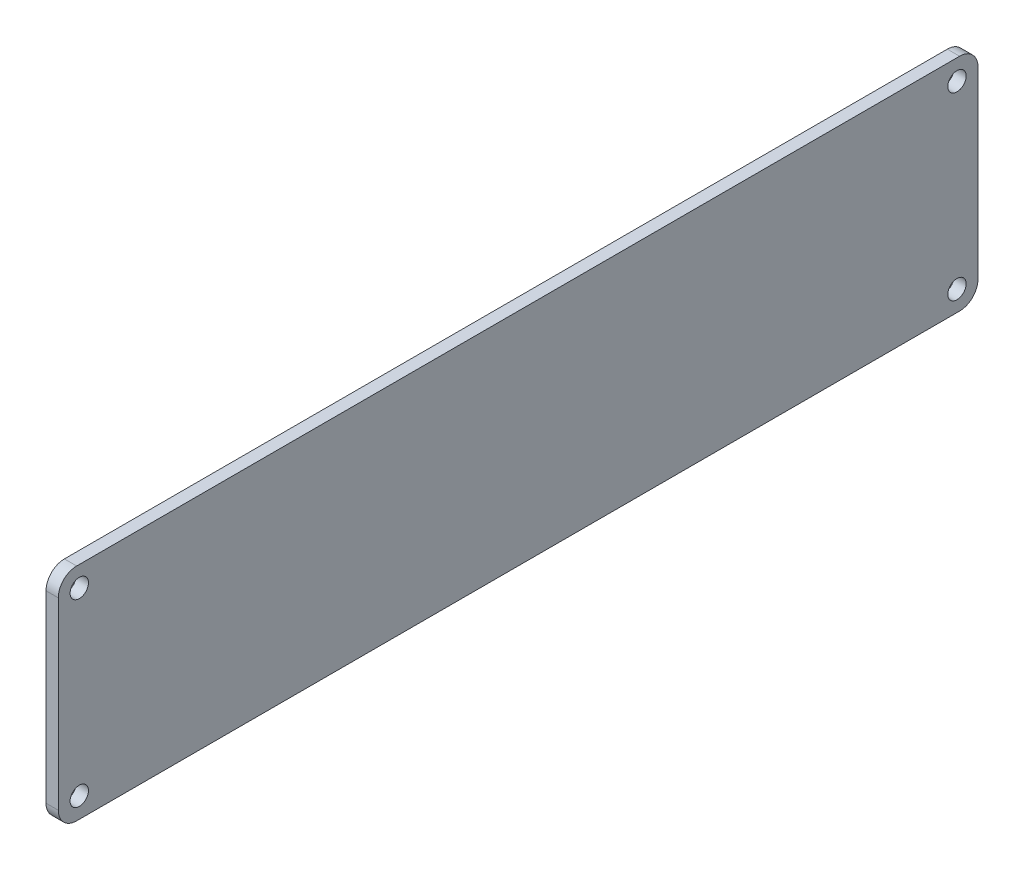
from build123d import *

# Parameters (mm, degrees)
SKETCH1_W           = 150
SKETCH1_H           = 36
BOSS_EXTRUDE1_DEPTH = 2
SKETCH2_R           = 1.5
CUT_EXTRUDE1_DEPTH  = 12
FILLET1_R           = 3


with BuildPart() as part:
    # Sketch1 → Boss-Extrude1 (new body)
    with BuildSketch(Plane(origin=(0, 0, 0), x_dir=(0, 0, -1), z_dir=(1, 0, 0))):
        Rectangle(SKETCH1_W, SKETCH1_H)
    extrude(amount=BOSS_EXTRUDE1_DEPTH)

    # Sketch2 → Cut-Extrude1 (cut)
    with BuildSketch(Plane(origin=(2, 0, 0), x_dir=(0, 0, -1), z_dir=(1, 0, 0))):
        with Locations((-71.570435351, 14.678887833)):
            Circle(SKETCH2_R)
        with Locations((71.570435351, 14.678887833)):
            Circle(SKETCH2_R)
        with Locations((71.570435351, -14.678887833)):
            Circle(SKETCH2_R)
        with Locations((-71.570435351, -14.678887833)):
            Circle(SKETCH2_R)
    extrude(amount=-CUT_EXTRUDE1_DEPTH, mode=Mode.SUBTRACT)

    # Fillet1
    fillet1_edges = [part.edges().sort_by_distance(p)[0] for p in [
        (1, -18, -75),
        (1, -18, 75),
        (1, 18, 75),
        (1, 18, -75),
    ]]
    fillet(fillet1_edges, radius=FILLET1_R)


solid = part.part
